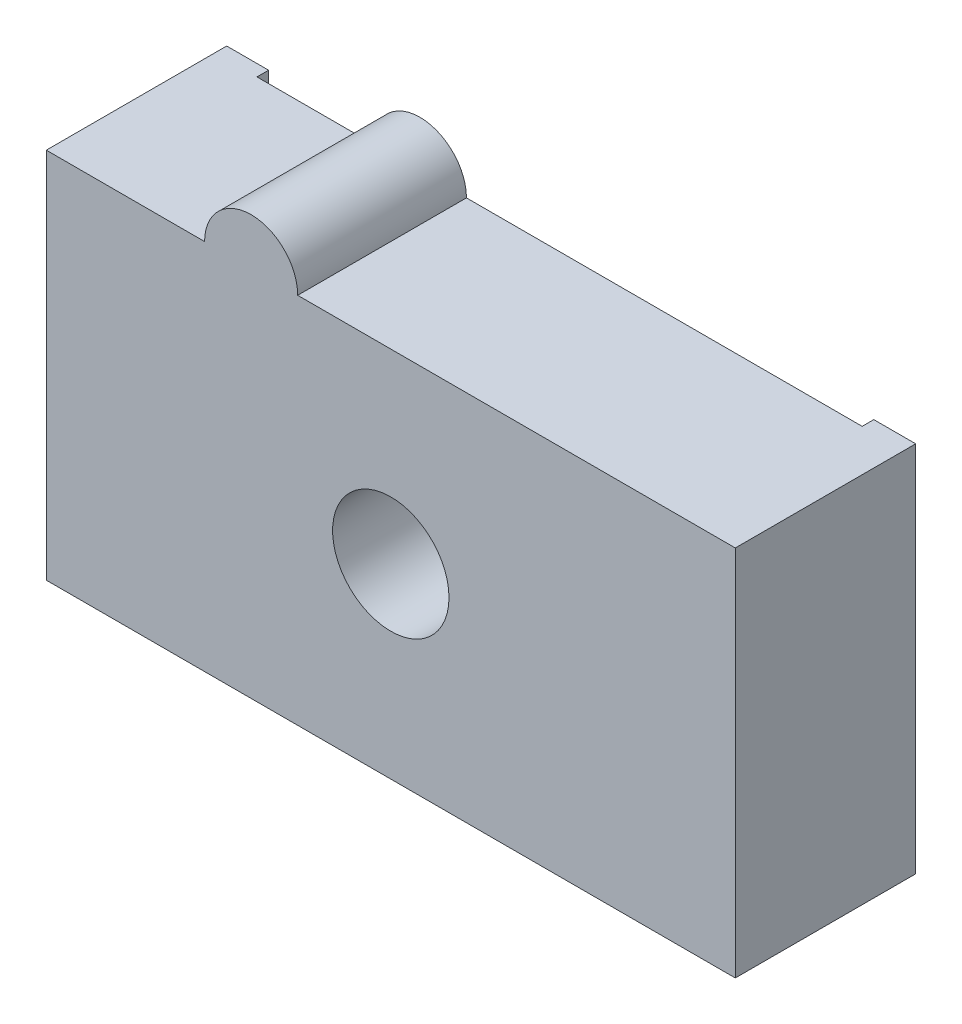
ISO-10303-21;
HEADER;
FILE_DESCRIPTION(('STEP AP214'),'2;1');
FILE_NAME('part.step','',(''),(''),'','','');
FILE_SCHEMA(('AUTOMOTIVE_DESIGN { 1 0 10303 214 1 1 1 1 }'));
ENDSEC;
DATA;
#1=APPLICATION_CONTEXT('core data for automotive mechanical design processes');
#2=APPLICATION_PROTOCOL_DEFINITION('international standard','automotive_design',2000,#1);
#3=PRODUCT_CONTEXT('',#1,'mechanical');
#4=PRODUCT('Part','Part','',(#3));
#5=PRODUCT_RELATED_PRODUCT_CATEGORY('part','',(#4));
#6=PRODUCT_DEFINITION_FORMATION('','',#4);
#7=PRODUCT_DEFINITION_CONTEXT('part definition',#1,'design');
#8=PRODUCT_DEFINITION('design','',#6,#7);
#9=PRODUCT_DEFINITION_SHAPE('','',#8);
#10=(LENGTH_UNIT() NAMED_UNIT(*) SI_UNIT(.MILLI.,.METRE.));
#11=(NAMED_UNIT(*) PLANE_ANGLE_UNIT() SI_UNIT($,.RADIAN.));
#12=(NAMED_UNIT(*) SI_UNIT($,.STERADIAN.) SOLID_ANGLE_UNIT());
#13=UNCERTAINTY_MEASURE_WITH_UNIT(LENGTH_MEASURE(1.E-05),#10,'distance_accuracy_value','');
#14=(GEOMETRIC_REPRESENTATION_CONTEXT(3) GLOBAL_UNCERTAINTY_ASSIGNED_CONTEXT((#13)) GLOBAL_UNIT_ASSIGNED_CONTEXT((#10,
#11,#12)) REPRESENTATION_CONTEXT('',''));
#15=CARTESIAN_POINT('',(0.,0.,0.));
#16=DIRECTION('',(0.,0.,1.));
#17=DIRECTION('',(1.,0.,0.));
#18=AXIS2_PLACEMENT_3D('',#15,#16,#17);
#19=CARTESIAN_POINT('',(-3.,-10.,3.875));
#20=DIRECTION('',(0.,0.,-1.));
#21=DIRECTION('',(-1.,0.,0.));
#22=AXIS2_PLACEMENT_3D('',#19,#20,#21);
#23=CYLINDRICAL_SURFACE('',#22,1.);
#24=CARTESIAN_POINT('',(-3.,-10.,0.25));
#25=DIRECTION('',(0.,0.,-1.));
#26=DIRECTION('',(-1.,0.,0.));
#27=AXIS2_PLACEMENT_3D('',#24,#25,#26);
#28=CIRCLE('',#27,1.);
#29=CARTESIAN_POINT('',(-4.,-10.,0.25));
#30=VERTEX_POINT('',#29);
#31=CARTESIAN_POINT('',(-2.,-10.,0.25));
#32=VERTEX_POINT('',#31);
#33=EDGE_CURVE('E189',#30,#32,#28,.T.);
#34=ORIENTED_EDGE('',*,*,#33,.F.);
#35=DIRECTION('',(0.,0.,-1.));
#36=VECTOR('',#35,1.);
#37=CARTESIAN_POINT('',(-4.,-10.,3.875));
#38=LINE('',#37,#36);
#39=CARTESIAN_POINT('',(-4.,-10.,3.875));
#40=VERTEX_POINT('',#39);
#41=EDGE_CURVE('E11',#40,#30,#38,.T.);
#42=ORIENTED_EDGE('',*,*,#41,.F.);
#43=CARTESIAN_POINT('',(-3.,-10.,3.875));
#44=DIRECTION('',(0.,0.,1.));
#45=DIRECTION('',(1.,0.,0.));
#46=AXIS2_PLACEMENT_3D('',#43,#44,#45);
#47=CIRCLE('',#46,1.);
#48=CARTESIAN_POINT('',(-2.,-10.,3.875));
#49=VERTEX_POINT('',#48);
#50=EDGE_CURVE('E142',#49,#40,#47,.T.);
#51=ORIENTED_EDGE('',*,*,#50,.F.);
#52=DIRECTION('',(0.,0.,-1.));
#53=VECTOR('',#52,1.);
#54=CARTESIAN_POINT('',(-2.,-10.,3.875));
#55=LINE('',#54,#53);
#56=EDGE_CURVE('E153',#49,#32,#55,.T.);
#57=ORIENTED_EDGE('',*,*,#56,.T.);
#58=EDGE_LOOP('',(#34,#42,#51,#57));
#59=FACE_BOUND('',#58,.T.);
#60=ADVANCED_FACE('F30',(#59),#23,.T.);
#61=CARTESIAN_POINT('',(-3.,-10.,0.));
#62=DIRECTION('',(0.,0.,1.));
#63=DIRECTION('',(1.,0.,0.));
#64=AXIS2_PLACEMENT_3D('',#61,#62,#63);
#65=PLANE('',#64);
#66=DIRECTION('',(-1.,0.,0.));
#67=VECTOR('',#66,1.);
#68=CARTESIAN_POINT('',(-7.4,-10.,0.));
#69=LINE('',#68,#67);
#70=CARTESIAN_POINT('',(-6.5,-10.,0.));
#71=VERTEX_POINT('',#70);
#72=CARTESIAN_POINT('',(-7.4,-10.,0.));
#73=VERTEX_POINT('',#72);
#74=EDGE_CURVE('E135',#71,#73,#69,.T.);
#75=ORIENTED_EDGE('',*,*,#74,.F.);
#76=DIRECTION('',(0.,1.,0.));
#77=VECTOR('',#76,1.);
#78=CARTESIAN_POINT('',(-6.5,-6.,0.));
#79=LINE('',#78,#77);
#80=CARTESIAN_POINT('',(-6.5,-18.,0.));
#81=VERTEX_POINT('',#80);
#82=EDGE_CURVE('E115',#81,#71,#79,.T.);
#83=ORIENTED_EDGE('',*,*,#82,.F.);
#84=DIRECTION('',(1.,0.,0.));
#85=VECTOR('',#84,1.);
#86=CARTESIAN_POINT('',(-7.4,-18.,0.));
#87=LINE('',#86,#85);
#88=CARTESIAN_POINT('',(-7.4,-18.,0.));
#89=VERTEX_POINT('',#88);
#90=EDGE_CURVE('E132',#89,#81,#87,.T.);
#91=ORIENTED_EDGE('',*,*,#90,.F.);
#92=DIRECTION('',(0.,-1.,0.));
#93=VECTOR('',#92,1.);
#94=CARTESIAN_POINT('',(-7.4,-18.,0.));
#95=LINE('',#94,#93);
#96=EDGE_CURVE('E133',#73,#89,#95,.T.);
#97=ORIENTED_EDGE('',*,*,#96,.F.);
#98=EDGE_LOOP('',(#75,#83,#91,#97));
#99=FACE_BOUND('',#98,.T.);
#100=ADVANCED_FACE('F175',(#99),#65,.F.);
#101=CARTESIAN_POINT('',(0.,-14.,0.));
#102=DIRECTION('',(0.,0.,1.));
#103=DIRECTION('',(1.,0.,0.));
#104=AXIS2_PLACEMENT_3D('',#101,#102,#103);
#105=CYLINDRICAL_SURFACE('',#104,1.25);
#106=CARTESIAN_POINT('',(0.,-14.,3.875));
#107=DIRECTION('',(0.,0.,1.));
#108=DIRECTION('',(1.,0.,0.));
#109=AXIS2_PLACEMENT_3D('',#106,#107,#108);
#110=CIRCLE('',#109,1.25);
#111=CARTESIAN_POINT('',(1.25,-14.,3.875));
#112=VERTEX_POINT('',#111);
#113=EDGE_CURVE('E202',#112,#112,#110,.T.);
#114=ORIENTED_EDGE('',*,*,#113,.T.);
#115=EDGE_LOOP('',(#114));
#116=FACE_BOUND('',#115,.T.);
#117=CARTESIAN_POINT('',(0.,-14.,0.25));
#118=DIRECTION('',(0.,0.,-1.));
#119=DIRECTION('',(-1.,0.,0.));
#120=AXIS2_PLACEMENT_3D('',#117,#118,#119);
#121=CIRCLE('',#120,1.25);
#122=CARTESIAN_POINT('',(-1.25,-14.,0.25));
#123=VERTEX_POINT('',#122);
#124=EDGE_CURVE('E33',#123,#123,#121,.F.);
#125=ORIENTED_EDGE('',*,*,#124,.F.);
#126=EDGE_LOOP('',(#125));
#127=FACE_BOUND('',#126,.T.);
#128=ADVANCED_FACE('F246',(#116,#127),#105,.F.);
#129=CARTESIAN_POINT('',(-7.4,-10.,3.875));
#130=DIRECTION('',(0.,-1.,0.));
#131=DIRECTION('',(1.,0.,0.));
#132=AXIS2_PLACEMENT_3D('',#129,#130,#131);
#133=PLANE('',#132);
#134=DIRECTION('',(1.,0.,0.));
#135=VECTOR('',#134,1.);
#136=CARTESIAN_POINT('',(-7.4,-10.,0.25));
#137=LINE('',#136,#135);
#138=CARTESIAN_POINT('',(-6.5,-10.,0.25));
#139=VERTEX_POINT('',#138);
#140=EDGE_CURVE('E186',#139,#30,#137,.T.);
#141=ORIENTED_EDGE('',*,*,#140,.F.);
#142=DIRECTION('',(0.,0.,-1.));
#143=VECTOR('',#142,1.);
#144=CARTESIAN_POINT('',(-6.5,-10.,3.875));
#145=LINE('',#144,#143);
#146=EDGE_CURVE('E200',#139,#71,#145,.T.);
#147=ORIENTED_EDGE('',*,*,#146,.T.);
#148=ORIENTED_EDGE('',*,*,#74,.T.);
#149=DIRECTION('',(0.,0.,-1.));
#150=VECTOR('',#149,1.);
#151=CARTESIAN_POINT('',(-7.4,-10.,3.875));
#152=LINE('',#151,#150);
#153=CARTESIAN_POINT('',(-7.4,-10.,3.875));
#154=VERTEX_POINT('',#153);
#155=EDGE_CURVE('E38',#154,#73,#152,.T.);
#156=ORIENTED_EDGE('',*,*,#155,.F.);
#157=DIRECTION('',(-1.,0.,0.));
#158=VECTOR('',#157,1.);
#159=CARTESIAN_POINT('',(-7.4,-10.,3.875));
#160=LINE('',#159,#158);
#161=EDGE_CURVE('E144',#40,#154,#160,.T.);
#162=ORIENTED_EDGE('',*,*,#161,.F.);
#163=ORIENTED_EDGE('',*,*,#41,.T.);
#164=EDGE_LOOP('',(#141,#147,#148,#156,#162,#163));
#165=FACE_BOUND('',#164,.T.);
#166=ADVANCED_FACE('F184',(#165),#133,.F.);
#167=CARTESIAN_POINT('',(-7.4,-18.,3.875));
#168=DIRECTION('',(1.,0.,0.));
#169=DIRECTION('',(0.,0.,-1.));
#170=AXIS2_PLACEMENT_3D('',#167,#168,#169);
#171=PLANE('',#170);
#172=ORIENTED_EDGE('',*,*,#96,.T.);
#173=DIRECTION('',(0.,0.,-1.));
#174=VECTOR('',#173,1.);
#175=CARTESIAN_POINT('',(-7.4,-18.,3.875));
#176=LINE('',#175,#174);
#177=CARTESIAN_POINT('',(-7.4,-18.,3.875));
#178=VERTEX_POINT('',#177);
#179=EDGE_CURVE('E161',#178,#89,#176,.T.);
#180=ORIENTED_EDGE('',*,*,#179,.F.);
#181=DIRECTION('',(0.,-1.,0.));
#182=VECTOR('',#181,1.);
#183=CARTESIAN_POINT('',(-7.4,-18.,3.875));
#184=LINE('',#183,#182);
#185=EDGE_CURVE('E146',#154,#178,#184,.T.);
#186=ORIENTED_EDGE('',*,*,#185,.F.);
#187=ORIENTED_EDGE('',*,*,#155,.T.);
#188=EDGE_LOOP('',(#172,#180,#186,#187));
#189=FACE_BOUND('',#188,.T.);
#190=ADVANCED_FACE('F169',(#189),#171,.F.);
#191=CARTESIAN_POINT('',(-7.4,-18.,3.875));
#192=DIRECTION('',(0.,1.,0.));
#193=DIRECTION('',(0.,0.,1.));
#194=AXIS2_PLACEMENT_3D('',#191,#192,#193);
#195=PLANE('',#194);
#196=ORIENTED_EDGE('',*,*,#90,.T.);
#197=DIRECTION('',(0.,0.,-1.));
#198=VECTOR('',#197,1.);
#199=CARTESIAN_POINT('',(-6.5,-18.,17.9418060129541));
#200=LINE('',#199,#198);
#201=CARTESIAN_POINT('',(-6.5,-18.,0.25));
#202=VERTEX_POINT('',#201);
#203=EDGE_CURVE('E127',#202,#81,#200,.T.);
#204=ORIENTED_EDGE('',*,*,#203,.F.);
#205=DIRECTION('',(1.,0.,0.));
#206=VECTOR('',#205,1.);
#207=CARTESIAN_POINT('',(-6.5,-18.,0.25));
#208=LINE('',#207,#206);
#209=CARTESIAN_POINT('',(6.5,-18.,0.25));
#210=VERTEX_POINT('',#209);
#211=EDGE_CURVE('E126',#202,#210,#208,.T.);
#212=ORIENTED_EDGE('',*,*,#211,.T.);
#213=DIRECTION('',(0.,0.,-1.));
#214=VECTOR('',#213,1.);
#215=CARTESIAN_POINT('',(6.5,-18.,17.9418060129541));
#216=LINE('',#215,#214);
#217=CARTESIAN_POINT('',(6.5,-18.,0.));
#218=VERTEX_POINT('',#217);
#219=EDGE_CURVE('E109',#210,#218,#216,.T.);
#220=ORIENTED_EDGE('',*,*,#219,.T.);
#221=CARTESIAN_POINT('',(7.4,-18.,0.));
#222=VERTEX_POINT('',#221);
#223=EDGE_CURVE('E122',#218,#222,#87,.T.);
#224=ORIENTED_EDGE('',*,*,#223,.T.);
#225=DIRECTION('',(0.,0.,-1.));
#226=VECTOR('',#225,1.);
#227=CARTESIAN_POINT('',(7.4,-18.,3.875));
#228=LINE('',#227,#226);
#229=CARTESIAN_POINT('',(7.4,-18.,3.875));
#230=VERTEX_POINT('',#229);
#231=EDGE_CURVE('E159',#230,#222,#228,.T.);
#232=ORIENTED_EDGE('',*,*,#231,.F.);
#233=DIRECTION('',(1.,0.,0.));
#234=VECTOR('',#233,1.);
#235=CARTESIAN_POINT('',(-7.4,-18.,3.875));
#236=LINE('',#235,#234);
#237=EDGE_CURVE('E148',#178,#230,#236,.T.);
#238=ORIENTED_EDGE('',*,*,#237,.F.);
#239=ORIENTED_EDGE('',*,*,#179,.T.);
#240=EDGE_LOOP('',(#196,#204,#212,#220,#224,#232,#238,#239));
#241=FACE_BOUND('',#240,.T.);
#242=ADVANCED_FACE('F120',(#241),#195,.F.);
#243=CARTESIAN_POINT('',(7.4,-18.,3.875));
#244=DIRECTION('',(-1.,0.,0.));
#245=DIRECTION('',(0.,0.,1.));
#246=AXIS2_PLACEMENT_3D('',#243,#244,#245);
#247=PLANE('',#246);
#248=DIRECTION('',(0.,1.,0.));
#249=VECTOR('',#248,1.);
#250=CARTESIAN_POINT('',(7.4,-18.,0.));
#251=LINE('',#250,#249);
#252=CARTESIAN_POINT('',(7.4,-10.,0.));
#253=VERTEX_POINT('',#252);
#254=EDGE_CURVE('E131',#222,#253,#251,.T.);
#255=ORIENTED_EDGE('',*,*,#254,.T.);
#256=DIRECTION('',(0.,0.,-1.));
#257=VECTOR('',#256,1.);
#258=CARTESIAN_POINT('',(7.4,-10.,3.875));
#259=LINE('',#258,#257);
#260=CARTESIAN_POINT('',(7.4,-10.,3.875));
#261=VERTEX_POINT('',#260);
#262=EDGE_CURVE('E156',#261,#253,#259,.T.);
#263=ORIENTED_EDGE('',*,*,#262,.F.);
#264=DIRECTION('',(0.,1.,0.));
#265=VECTOR('',#264,1.);
#266=CARTESIAN_POINT('',(7.4,-18.,3.875));
#267=LINE('',#266,#265);
#268=EDGE_CURVE('E150',#230,#261,#267,.T.);
#269=ORIENTED_EDGE('',*,*,#268,.F.);
#270=ORIENTED_EDGE('',*,*,#231,.T.);
#271=EDGE_LOOP('',(#255,#263,#269,#270));
#272=FACE_BOUND('',#271,.T.);
#273=ADVANCED_FACE('F264',(#272),#247,.F.);
#274=CARTESIAN_POINT('',(-2.,-10.,3.875));
#275=DIRECTION('',(0.,-1.,0.));
#276=DIRECTION('',(1.,0.,0.));
#277=AXIS2_PLACEMENT_3D('',#274,#275,#276);
#278=PLANE('',#277);
#279=DIRECTION('',(-1.,0.,0.));
#280=VECTOR('',#279,1.);
#281=CARTESIAN_POINT('',(-2.,-10.,0.));
#282=LINE('',#281,#280);
#283=CARTESIAN_POINT('',(6.5,-10.,0.));
#284=VERTEX_POINT('',#283);
#285=EDGE_CURVE('E140',#253,#284,#282,.T.);
#286=ORIENTED_EDGE('',*,*,#285,.T.);
#287=DIRECTION('',(0.,0.,1.));
#288=VECTOR('',#287,1.);
#289=CARTESIAN_POINT('',(6.5,-10.,3.875));
#290=LINE('',#289,#288);
#291=CARTESIAN_POINT('',(6.5,-10.,0.25));
#292=VERTEX_POINT('',#291);
#293=EDGE_CURVE('E45',#284,#292,#290,.T.);
#294=ORIENTED_EDGE('',*,*,#293,.T.);
#295=DIRECTION('',(1.,0.,0.));
#296=VECTOR('',#295,1.);
#297=CARTESIAN_POINT('',(-2.,-10.,0.25));
#298=LINE('',#297,#296);
#299=EDGE_CURVE('E192',#32,#292,#298,.T.);
#300=ORIENTED_EDGE('',*,*,#299,.F.);
#301=ORIENTED_EDGE('',*,*,#56,.F.);
#302=DIRECTION('',(-1.,0.,0.));
#303=VECTOR('',#302,1.);
#304=CARTESIAN_POINT('',(-2.,-10.,3.875));
#305=LINE('',#304,#303);
#306=EDGE_CURVE('E53',#261,#49,#305,.T.);
#307=ORIENTED_EDGE('',*,*,#306,.F.);
#308=ORIENTED_EDGE('',*,*,#262,.T.);
#309=EDGE_LOOP('',(#286,#294,#300,#301,#307,#308));
#310=FACE_BOUND('',#309,.T.);
#311=ADVANCED_FACE('F259',(#310),#278,.F.);
#312=CARTESIAN_POINT('',(-3.,-10.,3.875));
#313=DIRECTION('',(0.,0.,1.));
#314=DIRECTION('',(1.,0.,0.));
#315=AXIS2_PLACEMENT_3D('',#312,#313,#314);
#316=PLANE('',#315);
#317=ORIENTED_EDGE('',*,*,#113,.F.);
#318=EDGE_LOOP('',(#317));
#319=FACE_BOUND('',#318,.T.);
#320=ORIENTED_EDGE('',*,*,#50,.T.);
#321=ORIENTED_EDGE('',*,*,#161,.T.);
#322=ORIENTED_EDGE('',*,*,#185,.T.);
#323=ORIENTED_EDGE('',*,*,#237,.T.);
#324=ORIENTED_EDGE('',*,*,#268,.T.);
#325=ORIENTED_EDGE('',*,*,#306,.T.);
#326=EDGE_LOOP('',(#320,#321,#322,#323,#324,#325));
#327=FACE_BOUND('',#326,.T.);
#328=ADVANCED_FACE('F179',(#319,#327),#316,.T.);
#329=ORIENTED_EDGE('',*,*,#223,.F.);
#330=DIRECTION('',(0.,-1.,0.));
#331=VECTOR('',#330,1.);
#332=CARTESIAN_POINT('',(6.5,-18.,0.));
#333=LINE('',#332,#331);
#334=EDGE_CURVE('E106',#284,#218,#333,.T.);
#335=ORIENTED_EDGE('',*,*,#334,.F.);
#336=ORIENTED_EDGE('',*,*,#285,.F.);
#337=ORIENTED_EDGE('',*,*,#254,.F.);
#338=EDGE_LOOP('',(#329,#335,#336,#337));
#339=FACE_BOUND('',#338,.T.);
#340=ADVANCED_FACE('F130',(#339),#65,.F.);
#341=CARTESIAN_POINT('',(-6.5,-6.,17.9418060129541));
#342=DIRECTION('',(-1.,0.,0.));
#343=DIRECTION('',(0.,-1.,0.));
#344=AXIS2_PLACEMENT_3D('',#341,#342,#343);
#345=PLANE('',#344);
#346=DIRECTION('',(0.,-1.,0.));
#347=VECTOR('',#346,1.);
#348=CARTESIAN_POINT('',(-6.5,-6.,0.25));
#349=LINE('',#348,#347);
#350=EDGE_CURVE('E213',#139,#202,#349,.T.);
#351=ORIENTED_EDGE('',*,*,#350,.T.);
#352=ORIENTED_EDGE('',*,*,#203,.T.);
#353=ORIENTED_EDGE('',*,*,#82,.T.);
#354=ORIENTED_EDGE('',*,*,#146,.F.);
#355=EDGE_LOOP('',(#351,#352,#353,#354));
#356=FACE_BOUND('',#355,.T.);
#357=ADVANCED_FACE('F212',(#356),#345,.F.);
#358=CARTESIAN_POINT('',(6.5,-18.,17.9418060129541));
#359=DIRECTION('',(1.,0.,0.));
#360=DIRECTION('',(0.,0.,-1.));
#361=AXIS2_PLACEMENT_3D('',#358,#359,#360);
#362=PLANE('',#361);
#363=ORIENTED_EDGE('',*,*,#334,.T.);
#364=ORIENTED_EDGE('',*,*,#219,.F.);
#365=DIRECTION('',(0.,1.,0.));
#366=VECTOR('',#365,1.);
#367=CARTESIAN_POINT('',(6.5,-18.,0.25));
#368=LINE('',#367,#366);
#369=EDGE_CURVE('E215',#210,#292,#368,.T.);
#370=ORIENTED_EDGE('',*,*,#369,.T.);
#371=ORIENTED_EDGE('',*,*,#293,.F.);
#372=EDGE_LOOP('',(#363,#364,#370,#371));
#373=FACE_BOUND('',#372,.T.);
#374=ADVANCED_FACE('F108',(#373),#362,.F.);
#375=CARTESIAN_POINT('',(6.5,-35.5,0.25));
#376=DIRECTION('',(0.,0.,-1.));
#377=DIRECTION('',(-1.,0.,0.));
#378=AXIS2_PLACEMENT_3D('',#375,#376,#377);
#379=PLANE('',#378);
#380=CARTESIAN_POINT('',(4.99377661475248,-11.6951800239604,0.25));
#381=DIRECTION('',(0.,0.,-1.));
#382=DIRECTION('',(-1.,0.,0.));
#383=AXIS2_PLACEMENT_3D('',#380,#381,#382);
#384=CIRCLE('',#383,0.999999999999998);
#385=CARTESIAN_POINT('',(3.99377661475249,-11.6951800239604,0.25));
#386=VERTEX_POINT('',#385);
#387=EDGE_CURVE('E195',#386,#386,#384,.F.);
#388=ORIENTED_EDGE('',*,*,#387,.T.);
#389=EDGE_LOOP('',(#388));
#390=FACE_BOUND('',#389,.T.);
#391=ORIENTED_EDGE('',*,*,#124,.T.);
#392=EDGE_LOOP('',(#391));
#393=FACE_BOUND('',#392,.T.);
#394=CARTESIAN_POINT('',(-4.99377661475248,-16.3048199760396,0.25));
#395=DIRECTION('',(0.,0.,-1.));
#396=DIRECTION('',(-1.,0.,0.));
#397=AXIS2_PLACEMENT_3D('',#394,#395,#396);
#398=CIRCLE('',#397,0.999999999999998);
#399=CARTESIAN_POINT('',(-5.99377661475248,-16.3048199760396,0.25));
#400=VERTEX_POINT('',#399);
#401=EDGE_CURVE('E222',#400,#400,#398,.F.);
#402=ORIENTED_EDGE('',*,*,#401,.T.);
#403=EDGE_LOOP('',(#402));
#404=FACE_BOUND('',#403,.T.);
#405=ORIENTED_EDGE('',*,*,#140,.T.);
#406=ORIENTED_EDGE('',*,*,#33,.T.);
#407=ORIENTED_EDGE('',*,*,#299,.T.);
#408=ORIENTED_EDGE('',*,*,#369,.F.);
#409=ORIENTED_EDGE('',*,*,#211,.F.);
#410=ORIENTED_EDGE('',*,*,#350,.F.);
#411=EDGE_LOOP('',(#405,#406,#407,#408,#409,#410));
#412=FACE_BOUND('',#411,.T.);
#413=ADVANCED_FACE('F214',(#390,#393,#404,#412),#379,.T.);
#414=CARTESIAN_POINT('',(-4.99377661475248,-16.3048199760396,3.));
#415=DIRECTION('',(0.,0.,-1.));
#416=DIRECTION('',(-1.,0.,0.));
#417=AXIS2_PLACEMENT_3D('',#414,#415,#416);
#418=PLANE('',#417);
#419=CARTESIAN_POINT('',(-4.99377661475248,-16.3048199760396,3.));
#420=DIRECTION('',(0.,0.,-1.));
#421=DIRECTION('',(-1.,0.,0.));
#422=AXIS2_PLACEMENT_3D('',#419,#420,#421);
#423=CIRCLE('',#422,0.999999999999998);
#424=CARTESIAN_POINT('',(-5.99377661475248,-16.3048199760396,3.));
#425=VERTEX_POINT('',#424);
#426=EDGE_CURVE('E205',#425,#425,#423,.T.);
#427=ORIENTED_EDGE('',*,*,#426,.T.);
#428=EDGE_LOOP('',(#427));
#429=FACE_BOUND('',#428,.T.);
#430=ADVANCED_FACE('F329',(#429),#418,.T.);
#431=CARTESIAN_POINT('',(-4.99377661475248,-16.3048199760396,3.));
#432=DIRECTION('',(0.,0.,-1.));
#433=DIRECTION('',(-1.,0.,0.));
#434=AXIS2_PLACEMENT_3D('',#431,#432,#433);
#435=CYLINDRICAL_SURFACE('',#434,0.999999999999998);
#436=ORIENTED_EDGE('',*,*,#426,.F.);
#437=EDGE_LOOP('',(#436));
#438=FACE_BOUND('',#437,.T.);
#439=ORIENTED_EDGE('',*,*,#401,.F.);
#440=EDGE_LOOP('',(#439));
#441=FACE_BOUND('',#440,.T.);
#442=ADVANCED_FACE('F237',(#438,#441),#435,.F.);
#443=CARTESIAN_POINT('',(4.99377661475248,-11.6951800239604,3.));
#444=DIRECTION('',(0.,0.,-1.));
#445=DIRECTION('',(-1.,0.,0.));
#446=AXIS2_PLACEMENT_3D('',#443,#444,#445);
#447=PLANE('',#446);
#448=CARTESIAN_POINT('',(4.99377661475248,-11.6951800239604,3.));
#449=DIRECTION('',(0.,0.,-1.));
#450=DIRECTION('',(-1.,0.,0.));
#451=AXIS2_PLACEMENT_3D('',#448,#449,#450);
#452=CIRCLE('',#451,0.999999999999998);
#453=CARTESIAN_POINT('',(3.99377661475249,-11.6951800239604,3.));
#454=VERTEX_POINT('',#453);
#455=EDGE_CURVE('E208',#454,#454,#452,.T.);
#456=ORIENTED_EDGE('',*,*,#455,.T.);
#457=EDGE_LOOP('',(#456));
#458=FACE_BOUND('',#457,.T.);
#459=ADVANCED_FACE('F231',(#458),#447,.T.);
#460=CARTESIAN_POINT('',(4.99377661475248,-11.6951800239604,3.));
#461=DIRECTION('',(0.,0.,-1.));
#462=DIRECTION('',(-1.,0.,0.));
#463=AXIS2_PLACEMENT_3D('',#460,#461,#462);
#464=CYLINDRICAL_SURFACE('',#463,0.999999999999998);
#465=ORIENTED_EDGE('',*,*,#455,.F.);
#466=EDGE_LOOP('',(#465));
#467=FACE_BOUND('',#466,.T.);
#468=ORIENTED_EDGE('',*,*,#387,.F.);
#469=EDGE_LOOP('',(#468));
#470=FACE_BOUND('',#469,.T.);
#471=ADVANCED_FACE('F229',(#467,#470),#464,.F.);
#472=CLOSED_SHELL('',(#60,#100,#128,#166,#190,#242,#273,#311,#328,#340,#357,#374,#413,#430,#442,
#459,#471));
#473=MANIFOLD_SOLID_BREP('B2',#472);
#474=ADVANCED_BREP_SHAPE_REPRESENTATION('',(#18,#473),#14);
#475=SHAPE_DEFINITION_REPRESENTATION(#9,#474);
ENDSEC;
END-ISO-10303-21;
